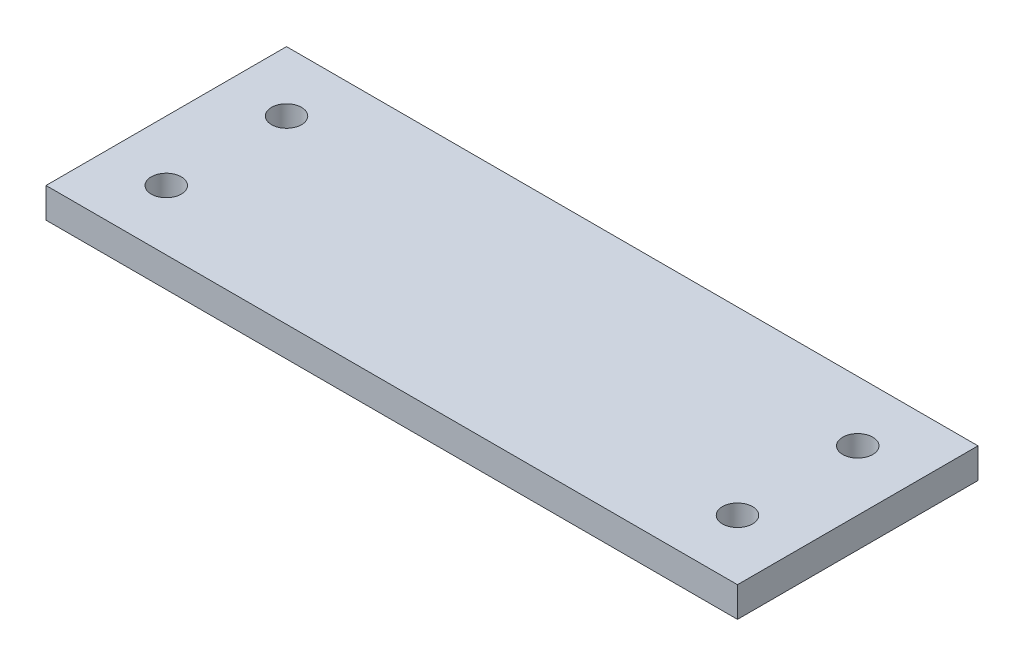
from build123d import *

# Parameters (mm, degrees)
SKETCH1_W           = 115
SKETCH1_H           = 40
SKETCH1_R           = 2.5
BOSS_EXTRUDE1_DEPTH = 5


with BuildPart() as part:
    # Sketch1 → Boss-Extrude1 (new body)
    with BuildSketch(Plane(origin=(0, 0, 0), x_dir=(1, 0, 0), z_dir=(0, 1, 0))):
        with Locations((57.5, 20)):
            Rectangle(SKETCH1_W, SKETCH1_H)
        with Locations(Location((10, 30, 0), (0, 0, 270))):
            Circle(SKETCH1_R, mode=Mode.SUBTRACT)
        with Locations(Location((10, 10, 0), (0, 0, 270))):
            Circle(SKETCH1_R, mode=Mode.SUBTRACT)
        with Locations(Location((105, 10, 0), (0, 0, 90))):
            Circle(SKETCH1_R, mode=Mode.SUBTRACT)
        with Locations(Location((105, 30, 0), (0, 0, 90))):
            Circle(SKETCH1_R, mode=Mode.SUBTRACT)
    extrude(amount=BOSS_EXTRUDE1_DEPTH)


solid = part.part
